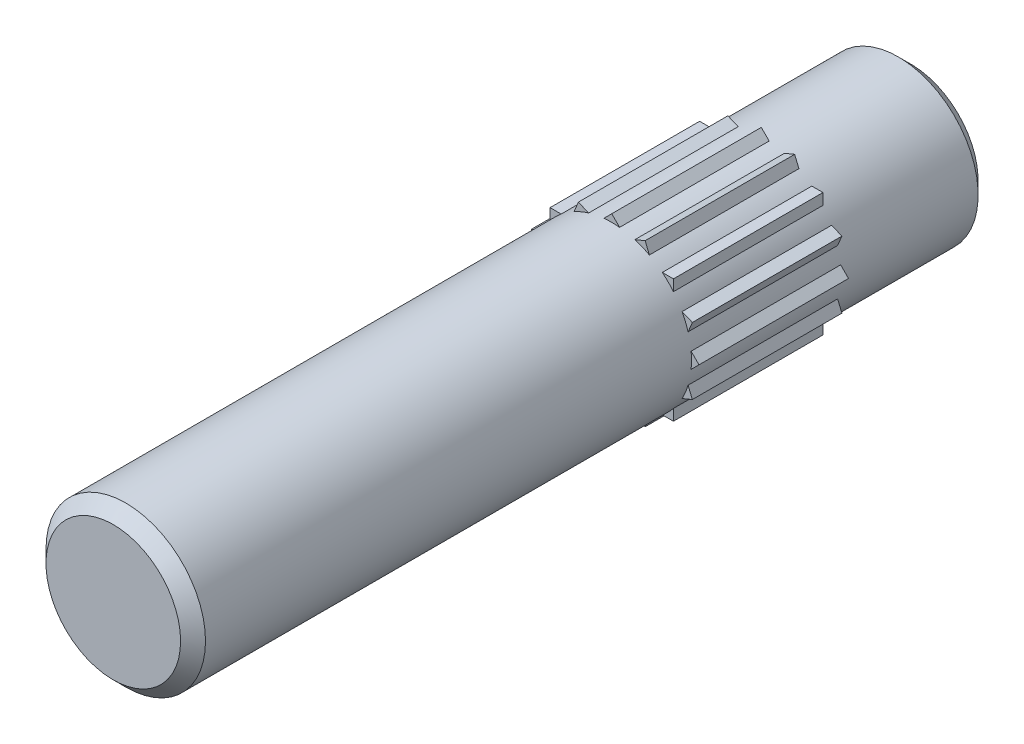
from build123d import *

# Parameters (mm, degrees)
ESQUISSE1_R                  = 1.6
BOSS_EXTRU_1_DEPTH           = 13
CHANFREIN1_SIZE              = 0.25
BOSS_EXTRU_2_DEPTH           = 3
R_P_TITION_CIRCULAIRE1_COUNT = 16
BOSS_EXTRU_3_START           = 3
ESQUISSE3_R                  = 1.6
BOSS_EXTRU_3_DEPTH           = 3
CHANFREIN2_SIZE              = 0.25


with BuildPart() as part:
    # Esquisse1 → Boss.-Extru.1 (new body)
    with BuildSketch(Plane.XY):
        with Locations(Location((0, 0, 0), (0, 0, 180))):
            Circle(ESQUISSE1_R)
    extrude(amount=BOSS_EXTRU_1_DEPTH)

    # Chanfrein1
    chanfrein1_edges = [part.edges().sort_by_distance(p)[0] for p in [
        (1.6, 0, 13),
    ]]
    chamfer(chanfrein1_edges, length=CHANFREIN1_SIZE)


with BuildPart() as body_2:
    # Esquisse2 → Boss.-Extru.2 (new body)
    with BuildSketch(Plane(origin=(0, 0, 0), x_dir=(-1, 0, 0), z_dir=(0, 0, -1))):
        with BuildLine():
            Line((1.75, 0), (1.592199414, 0.157800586))
            ThreePointArc((1.592199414, 0.157800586), (1.6, 0), (1.592199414, -0.157800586))
            Line((1.592199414, -0.157800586), (1.75, 0))
        make_face()
    boss_extru_2 = extrude(amount=-BOSS_EXTRU_2_DEPTH)


with BuildPart() as part_1:
    add(part.part)

    # R_p_tition circulaire1: Boss.-Extru.2 ×16 about axis
    r_p_tition_circulaire1_axis = Axis((0, 0, 0), (0, 0, 1))
    for i in range(1, R_P_TITION_CIRCULAIRE1_COUNT):
        add(boss_extru_2.rotate(r_p_tition_circulaire1_axis, i * 360 / R_P_TITION_CIRCULAIRE1_COUNT))

    add(body_2.part)  # Boss.-Extru.3 merges body 2
    # Esquisse3 → Boss.-Extru.3 (add)
    with BuildSketch(Plane(origin=(0, 0, 0), x_dir=(-1, 0, 0), z_dir=(0, 0, -1)).offset(BOSS_EXTRU_3_START)):
        Circle(ESQUISSE3_R)
    extrude(amount=-BOSS_EXTRU_3_DEPTH)

    # Chanfrein2
    chanfrein2_edges = [part_1.edges().sort_by_distance(p)[0] for p in [
        (1.6, 0, -3),
    ]]
    chamfer(chanfrein2_edges, length=CHANFREIN2_SIZE)


solid = part_1.part
